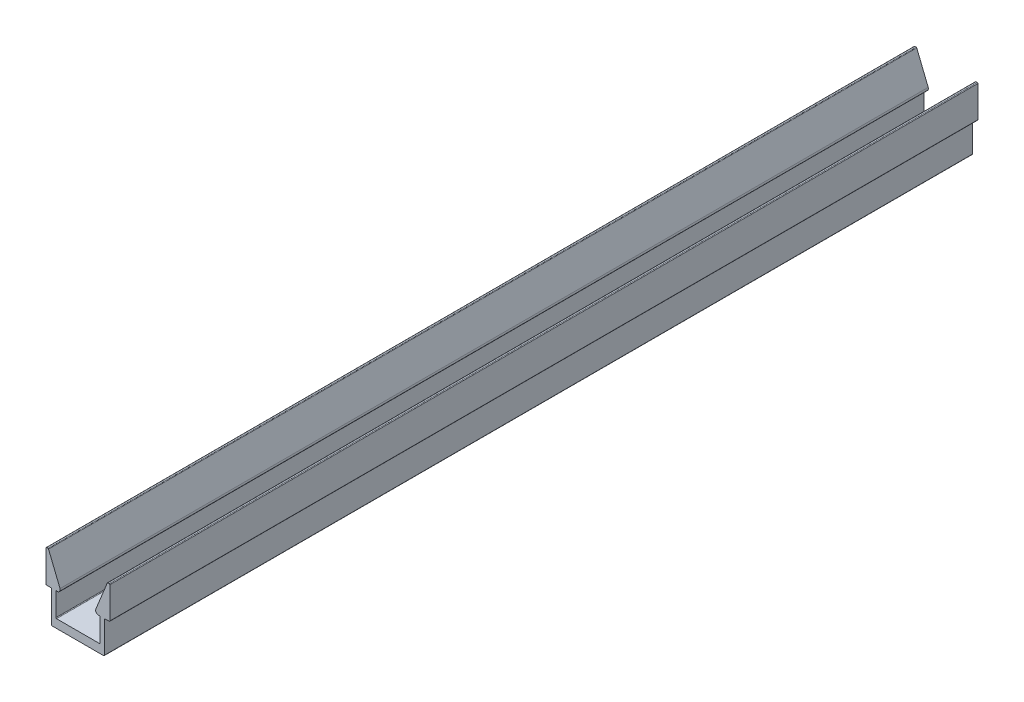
ISO-10303-21;
HEADER;
FILE_DESCRIPTION(('STEP AP214'),'2;1');
FILE_NAME('part.step','',(''),(''),'','','');
FILE_SCHEMA(('AUTOMOTIVE_DESIGN { 1 0 10303 214 1 1 1 1 }'));
ENDSEC;
DATA;
#1=APPLICATION_CONTEXT('core data for automotive mechanical design processes');
#2=APPLICATION_PROTOCOL_DEFINITION('international standard','automotive_design',2000,#1);
#3=PRODUCT_CONTEXT('',#1,'mechanical');
#4=PRODUCT('Part','Part','',(#3));
#5=PRODUCT_RELATED_PRODUCT_CATEGORY('part','',(#4));
#6=PRODUCT_DEFINITION_FORMATION('','',#4);
#7=PRODUCT_DEFINITION_CONTEXT('part definition',#1,'design');
#8=PRODUCT_DEFINITION('design','',#6,#7);
#9=PRODUCT_DEFINITION_SHAPE('','',#8);
#10=(LENGTH_UNIT() NAMED_UNIT(*) SI_UNIT(.MILLI.,.METRE.));
#11=(NAMED_UNIT(*) PLANE_ANGLE_UNIT() SI_UNIT($,.RADIAN.));
#12=(NAMED_UNIT(*) SI_UNIT($,.STERADIAN.) SOLID_ANGLE_UNIT());
#13=UNCERTAINTY_MEASURE_WITH_UNIT(LENGTH_MEASURE(1.E-05),#10,'distance_accuracy_value','');
#14=(GEOMETRIC_REPRESENTATION_CONTEXT(3) GLOBAL_UNCERTAINTY_ASSIGNED_CONTEXT((#13)) GLOBAL_UNIT_ASSIGNED_CONTEXT((#10,
#11,#12)) REPRESENTATION_CONTEXT('',''));
#15=CARTESIAN_POINT('',(0.,0.,0.));
#16=DIRECTION('',(0.,0.,1.));
#17=DIRECTION('',(1.,0.,0.));
#18=AXIS2_PLACEMENT_3D('',#15,#16,#17);
#19=CARTESIAN_POINT('',(-12.5095,4.953,0.));
#20=DIRECTION('',(0.,-1.,0.));
#21=DIRECTION('',(0.,0.,1.));
#22=AXIS2_PLACEMENT_3D('',#19,#20,#21);
#23=PLANE('',#22);
#24=DIRECTION('',(0.,0.,1.));
#25=VECTOR('',#24,1.);
#26=CARTESIAN_POINT('',(-12.5095,4.953,0.));
#27=LINE('',#26,#25);
#28=CARTESIAN_POINT('',(-12.5095,4.953,0.));
#29=VERTEX_POINT('',#28);
#30=CARTESIAN_POINT('',(-12.5095,4.953,508.));
#31=VERTEX_POINT('',#30);
#32=EDGE_CURVE('E22',#29,#31,#27,.T.);
#33=ORIENTED_EDGE('',*,*,#32,.T.);
#34=DIRECTION('',(1.,0.,0.));
#35=VECTOR('',#34,1.);
#36=CARTESIAN_POINT('',(-12.5095,4.953,508.));
#37=LINE('',#36,#35);
#38=CARTESIAN_POINT('',(12.5095,4.953,508.));
#39=VERTEX_POINT('',#38);
#40=EDGE_CURVE('E234',#31,#39,#37,.T.);
#41=ORIENTED_EDGE('',*,*,#40,.T.);
#42=DIRECTION('',(0.,0.,1.));
#43=VECTOR('',#42,1.);
#44=CARTESIAN_POINT('',(12.5095,4.953,0.));
#45=LINE('',#44,#43);
#46=CARTESIAN_POINT('',(12.5095,4.953,0.));
#47=VERTEX_POINT('',#46);
#48=EDGE_CURVE('E422',#47,#39,#45,.T.);
#49=ORIENTED_EDGE('',*,*,#48,.F.);
#50=DIRECTION('',(1.,0.,0.));
#51=VECTOR('',#50,1.);
#52=CARTESIAN_POINT('',(-12.5095,4.953,0.));
#53=LINE('',#52,#51);
#54=EDGE_CURVE('E317',#29,#47,#53,.T.);
#55=ORIENTED_EDGE('',*,*,#54,.F.);
#56=EDGE_LOOP('',(#33,#41,#49,#55));
#57=FACE_BOUND('',#56,.T.);
#58=ADVANCED_FACE('F14',(#57),#23,.F.);
#59=CARTESIAN_POINT('',(15.0495,0.,0.));
#60=DIRECTION('',(0.,1.,0.));
#61=DIRECTION('',(0.,0.,-1.));
#62=AXIS2_PLACEMENT_3D('',#59,#60,#61);
#63=PLANE('',#62);
#64=DIRECTION('',(0.,0.,1.));
#65=VECTOR('',#64,1.);
#66=CARTESIAN_POINT('',(15.0495,0.,0.));
#67=LINE('',#66,#65);
#68=CARTESIAN_POINT('',(15.0495,0.,0.));
#69=VERTEX_POINT('',#68);
#70=CARTESIAN_POINT('',(15.0495,0.,508.));
#71=VERTEX_POINT('',#70);
#72=EDGE_CURVE('E394',#69,#71,#67,.T.);
#73=ORIENTED_EDGE('',*,*,#72,.T.);
#74=DIRECTION('',(-1.,0.,0.));
#75=VECTOR('',#74,1.);
#76=CARTESIAN_POINT('',(15.0495,0.,508.));
#77=LINE('',#76,#75);
#78=CARTESIAN_POINT('',(-15.0495,0.,508.));
#79=VERTEX_POINT('',#78);
#80=EDGE_CURVE('E279',#71,#79,#77,.T.);
#81=ORIENTED_EDGE('',*,*,#80,.T.);
#82=DIRECTION('',(0.,0.,1.));
#83=VECTOR('',#82,1.);
#84=CARTESIAN_POINT('',(-15.0495,0.,0.));
#85=LINE('',#84,#83);
#86=CARTESIAN_POINT('',(-15.0495,0.,0.));
#87=VERTEX_POINT('',#86);
#88=EDGE_CURVE('E392',#87,#79,#85,.T.);
#89=ORIENTED_EDGE('',*,*,#88,.F.);
#90=DIRECTION('',(-1.,0.,0.));
#91=VECTOR('',#90,1.);
#92=CARTESIAN_POINT('',(15.0495,0.,0.));
#93=LINE('',#92,#91);
#94=EDGE_CURVE('E347',#69,#87,#93,.T.);
#95=ORIENTED_EDGE('',*,*,#94,.F.);
#96=EDGE_LOOP('',(#73,#81,#89,#95));
#97=FACE_BOUND('',#96,.T.);
#98=ADVANCED_FACE('F443',(#97),#63,.F.);
#99=CARTESIAN_POINT('',(-12.8905,19.05,0.));
#100=DIRECTION('',(-1.,0.,0.));
#101=DIRECTION('',(0.,0.,1.));
#102=AXIS2_PLACEMENT_3D('',#99,#100,#101);
#103=PLANE('',#102);
#104=DIRECTION('',(0.,0.,1.));
#105=VECTOR('',#104,1.);
#106=CARTESIAN_POINT('',(-12.8905,19.05,0.));
#107=LINE('',#106,#105);
#108=CARTESIAN_POINT('',(-12.8905,19.05,0.));
#109=VERTEX_POINT('',#108);
#110=CARTESIAN_POINT('',(-12.8905,19.05,508.));
#111=VERTEX_POINT('',#110);
#112=EDGE_CURVE('E210',#109,#111,#107,.T.);
#113=ORIENTED_EDGE('',*,*,#112,.T.);
#114=DIRECTION('',(0.,-1.,0.));
#115=VECTOR('',#114,1.);
#116=CARTESIAN_POINT('',(-12.8905,19.05,508.));
#117=LINE('',#116,#115);
#118=CARTESIAN_POINT('',(-12.8905,5.334,508.));
#119=VERTEX_POINT('',#118);
#120=EDGE_CURVE('E213',#111,#119,#117,.T.);
#121=ORIENTED_EDGE('',*,*,#120,.T.);
#122=DIRECTION('',(0.,0.,1.));
#123=VECTOR('',#122,1.);
#124=CARTESIAN_POINT('',(-12.8905,5.334,0.));
#125=LINE('',#124,#123);
#126=CARTESIAN_POINT('',(-12.8905,5.334,0.));
#127=VERTEX_POINT('',#126);
#128=EDGE_CURVE('E9',#127,#119,#125,.T.);
#129=ORIENTED_EDGE('',*,*,#128,.F.);
#130=DIRECTION('',(0.,-1.,0.));
#131=VECTOR('',#130,1.);
#132=CARTESIAN_POINT('',(-12.8905,19.05,0.));
#133=LINE('',#132,#131);
#134=EDGE_CURVE('E214',#109,#127,#133,.T.);
#135=ORIENTED_EDGE('',*,*,#134,.F.);
#136=EDGE_LOOP('',(#113,#121,#129,#135));
#137=FACE_BOUND('',#136,.T.);
#138=ADVANCED_FACE('F16',(#137),#103,.F.);
#139=CARTESIAN_POINT('',(-12.5095,5.334,0.));
#140=DIRECTION('',(0.,0.,1.));
#141=DIRECTION('',(1.,0.,0.));
#142=AXIS2_PLACEMENT_3D('',#139,#140,#141);
#143=CYLINDRICAL_SURFACE('',#142,0.381);
#144=ORIENTED_EDGE('',*,*,#128,.T.);
#145=CARTESIAN_POINT('',(-12.5095,5.334,508.));
#146=DIRECTION('',(0.,0.,1.));
#147=DIRECTION('',(0.,-1.,0.));
#148=AXIS2_PLACEMENT_3D('',#145,#146,#147);
#149=CIRCLE('',#148,0.381);
#150=EDGE_CURVE('E228',#119,#31,#149,.T.);
#151=ORIENTED_EDGE('',*,*,#150,.T.);
#152=ORIENTED_EDGE('',*,*,#32,.F.);
#153=CARTESIAN_POINT('',(-12.5095,5.334,0.));
#154=DIRECTION('',(0.,0.,1.));
#155=DIRECTION('',(1.,0.,0.));
#156=AXIS2_PLACEMENT_3D('',#153,#154,#155);
#157=CIRCLE('',#156,0.381);
#158=EDGE_CURVE('E315',#127,#29,#157,.T.);
#159=ORIENTED_EDGE('',*,*,#158,.F.);
#160=EDGE_LOOP('',(#144,#151,#152,#159));
#161=FACE_BOUND('',#160,.T.);
#162=ADVANCED_FACE('F430',(#161),#143,.F.);
#163=CARTESIAN_POINT('',(12.5095,5.334,0.));
#164=DIRECTION('',(0.,0.,1.));
#165=DIRECTION('',(1.,0.,0.));
#166=AXIS2_PLACEMENT_3D('',#163,#164,#165);
#167=CYLINDRICAL_SURFACE('',#166,0.381);
#168=ORIENTED_EDGE('',*,*,#48,.T.);
#169=CARTESIAN_POINT('',(12.5095,5.334,508.));
#170=DIRECTION('',(0.,0.,1.));
#171=DIRECTION('',(0.,-1.,0.));
#172=AXIS2_PLACEMENT_3D('',#169,#170,#171);
#173=CIRCLE('',#172,0.381);
#174=CARTESIAN_POINT('',(12.8905,5.334,508.));
#175=VERTEX_POINT('',#174);
#176=EDGE_CURVE('E237',#39,#175,#173,.T.);
#177=ORIENTED_EDGE('',*,*,#176,.T.);
#178=DIRECTION('',(0.,0.,1.));
#179=VECTOR('',#178,1.);
#180=CARTESIAN_POINT('',(12.8905,5.334,0.));
#181=LINE('',#180,#179);
#182=CARTESIAN_POINT('',(12.8905,5.334,0.));
#183=VERTEX_POINT('',#182);
#184=EDGE_CURVE('E420',#183,#175,#181,.T.);
#185=ORIENTED_EDGE('',*,*,#184,.F.);
#186=CARTESIAN_POINT('',(12.5095,5.334,0.));
#187=DIRECTION('',(0.,0.,1.));
#188=DIRECTION('',(-1.,0.,0.));
#189=AXIS2_PLACEMENT_3D('',#186,#187,#188);
#190=CIRCLE('',#189,0.381);
#191=EDGE_CURVE('E319',#47,#183,#190,.T.);
#192=ORIENTED_EDGE('',*,*,#191,.F.);
#193=EDGE_LOOP('',(#168,#177,#185,#192));
#194=FACE_BOUND('',#193,.T.);
#195=ADVANCED_FACE('F451',(#194),#167,.F.);
#196=CARTESIAN_POINT('',(12.8905,19.05,0.));
#197=DIRECTION('',(1.,0.,0.));
#198=DIRECTION('',(0.,0.,-1.));
#199=AXIS2_PLACEMENT_3D('',#196,#197,#198);
#200=PLANE('',#199);
#201=ORIENTED_EDGE('',*,*,#184,.T.);
#202=DIRECTION('',(0.,1.,0.));
#203=VECTOR('',#202,1.);
#204=CARTESIAN_POINT('',(12.8905,5.334,508.));
#205=LINE('',#204,#203);
#206=CARTESIAN_POINT('',(12.8905,19.05,508.));
#207=VERTEX_POINT('',#206);
#208=EDGE_CURVE('E240',#175,#207,#205,.T.);
#209=ORIENTED_EDGE('',*,*,#208,.T.);
#210=DIRECTION('',(0.,0.,1.));
#211=VECTOR('',#210,1.);
#212=CARTESIAN_POINT('',(12.8905,19.05,0.));
#213=LINE('',#212,#211);
#214=CARTESIAN_POINT('',(12.8905,19.05,0.));
#215=VERTEX_POINT('',#214);
#216=EDGE_CURVE('E418',#215,#207,#213,.T.);
#217=ORIENTED_EDGE('',*,*,#216,.F.);
#218=DIRECTION('',(0.,1.,0.));
#219=VECTOR('',#218,1.);
#220=CARTESIAN_POINT('',(12.8905,19.05,0.));
#221=LINE('',#220,#219);
#222=EDGE_CURVE('E321',#183,#215,#221,.T.);
#223=ORIENTED_EDGE('',*,*,#222,.F.);
#224=EDGE_LOOP('',(#201,#209,#217,#223));
#225=FACE_BOUND('',#224,.T.);
#226=ADVANCED_FACE('F458',(#225),#200,.F.);
#227=CARTESIAN_POINT('',(11.9288659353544,19.05,0.));
#228=DIRECTION('',(0.,1.,0.));
#229=DIRECTION('',(0.,0.,-1.));
#230=AXIS2_PLACEMENT_3D('',#227,#228,#229);
#231=PLANE('',#230);
#232=ORIENTED_EDGE('',*,*,#216,.T.);
#233=DIRECTION('',(-1.,0.,0.));
#234=VECTOR('',#233,1.);
#235=CARTESIAN_POINT('',(12.8905,19.05,508.));
#236=LINE('',#235,#234);
#237=CARTESIAN_POINT('',(11.9288659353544,19.05,508.));
#238=VERTEX_POINT('',#237);
#239=EDGE_CURVE('E243',#207,#238,#236,.T.);
#240=ORIENTED_EDGE('',*,*,#239,.T.);
#241=DIRECTION('',(0.,0.,1.));
#242=VECTOR('',#241,1.);
#243=CARTESIAN_POINT('',(11.9288659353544,19.05,0.));
#244=LINE('',#243,#242);
#245=CARTESIAN_POINT('',(11.9288659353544,19.05,0.));
#246=VERTEX_POINT('',#245);
#247=EDGE_CURVE('E416',#246,#238,#244,.T.);
#248=ORIENTED_EDGE('',*,*,#247,.F.);
#249=DIRECTION('',(-1.,0.,0.));
#250=VECTOR('',#249,1.);
#251=CARTESIAN_POINT('',(11.9288659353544,19.05,0.));
#252=LINE('',#251,#250);
#253=EDGE_CURVE('E323',#215,#246,#252,.T.);
#254=ORIENTED_EDGE('',*,*,#253,.F.);
#255=EDGE_LOOP('',(#232,#240,#248,#254));
#256=FACE_BOUND('',#255,.T.);
#257=ADVANCED_FACE('F498',(#256),#231,.F.);
#258=CARTESIAN_POINT('',(11.9288659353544,20.6375,0.));
#259=DIRECTION('',(0.,0.,1.));
#260=DIRECTION('',(1.,0.,0.));
#261=AXIS2_PLACEMENT_3D('',#258,#259,#260);
#262=CYLINDRICAL_SURFACE('',#261,1.5875);
#263=ORIENTED_EDGE('',*,*,#247,.T.);
#264=CARTESIAN_POINT('',(11.9288659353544,20.6375,508.));
#265=DIRECTION('',(0.,0.,-1.));
#266=DIRECTION('',(0.,-1.,0.));
#267=AXIS2_PLACEMENT_3D('',#264,#265,#266);
#268=CIRCLE('',#267,1.5875);
#269=CARTESIAN_POINT('',(10.4569615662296,21.2321879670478,508.));
#270=VERTEX_POINT('',#269);
#271=EDGE_CURVE('E246',#238,#270,#268,.T.);
#272=ORIENTED_EDGE('',*,*,#271,.T.);
#273=DIRECTION('',(0.,0.,1.));
#274=VECTOR('',#273,1.);
#275=CARTESIAN_POINT('',(10.4569615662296,21.2321879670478,0.));
#276=LINE('',#275,#274);
#277=CARTESIAN_POINT('',(10.4569615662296,21.2321879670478,0.));
#278=VERTEX_POINT('',#277);
#279=EDGE_CURVE('E414',#278,#270,#276,.T.);
#280=ORIENTED_EDGE('',*,*,#279,.F.);
#281=CARTESIAN_POINT('',(11.9288659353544,20.6375,0.));
#282=DIRECTION('',(0.,0.,-1.));
#283=DIRECTION('',(1.,0.,0.));
#284=AXIS2_PLACEMENT_3D('',#281,#282,#283);
#285=CIRCLE('',#284,1.5875);
#286=EDGE_CURVE('E325',#246,#278,#285,.T.);
#287=ORIENTED_EDGE('',*,*,#286,.F.);
#288=EDGE_LOOP('',(#263,#272,#280,#287));
#289=FACE_BOUND('',#288,.T.);
#290=ADVANCED_FACE('F506',(#289),#262,.T.);
#291=CARTESIAN_POINT('',(17.175730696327,37.8617251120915,0.));
#292=DIRECTION('',(0.92718385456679,-0.374606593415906,0.));
#293=DIRECTION('',(-0.374606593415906,-0.92718385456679,0.));
#294=AXIS2_PLACEMENT_3D('',#291,#292,#293);
#295=PLANE('',#294);
#296=ORIENTED_EDGE('',*,*,#279,.T.);
#297=DIRECTION('',(0.374606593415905,0.92718385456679,0.));
#298=VECTOR('',#297,1.);
#299=CARTESIAN_POINT('',(10.4569615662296,21.2321879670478,508.));
#300=LINE('',#299,#298);
#301=CARTESIAN_POINT('',(17.175730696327,37.8617251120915,508.));
#302=VERTEX_POINT('',#301);
#303=EDGE_CURVE('E249',#270,#302,#300,.T.);
#304=ORIENTED_EDGE('',*,*,#303,.T.);
#305=DIRECTION('',(0.,0.,1.));
#306=VECTOR('',#305,1.);
#307=CARTESIAN_POINT('',(17.175730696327,37.8617251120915,0.));
#308=LINE('',#307,#306);
#309=CARTESIAN_POINT('',(17.175730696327,37.8617251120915,0.));
#310=VERTEX_POINT('',#309);
#311=EDGE_CURVE('E412',#310,#302,#308,.T.);
#312=ORIENTED_EDGE('',*,*,#311,.F.);
#313=DIRECTION('',(0.374606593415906,0.92718385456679,0.));
#314=VECTOR('',#313,1.);
#315=CARTESIAN_POINT('',(17.175730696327,37.8617251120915,0.));
#316=LINE('',#315,#314);
#317=EDGE_CURVE('E327',#278,#310,#316,.T.);
#318=ORIENTED_EDGE('',*,*,#317,.F.);
#319=EDGE_LOOP('',(#296,#304,#312,#318));
#320=FACE_BOUND('',#319,.T.);
#321=ADVANCED_FACE('F515',(#320),#295,.F.);
#322=CARTESIAN_POINT('',(17.528987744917,37.719,0.));
#323=DIRECTION('',(0.,0.,1.));
#324=DIRECTION('',(1.,0.,0.));
#325=AXIS2_PLACEMENT_3D('',#322,#323,#324);
#326=CYLINDRICAL_SURFACE('',#325,0.381);
#327=ORIENTED_EDGE('',*,*,#311,.T.);
#328=CARTESIAN_POINT('',(17.528987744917,37.719,508.));
#329=DIRECTION('',(0.,0.,-1.));
#330=DIRECTION('',(0.,-1.,0.));
#331=AXIS2_PLACEMENT_3D('',#328,#329,#330);
#332=CIRCLE('',#331,0.381);
#333=CARTESIAN_POINT('',(17.528987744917,38.1,508.));
#334=VERTEX_POINT('',#333);
#335=EDGE_CURVE('E252',#302,#334,#332,.T.);
#336=ORIENTED_EDGE('',*,*,#335,.T.);
#337=DIRECTION('',(0.,0.,1.));
#338=VECTOR('',#337,1.);
#339=CARTESIAN_POINT('',(17.528987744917,38.1,0.));
#340=LINE('',#339,#338);
#341=CARTESIAN_POINT('',(17.528987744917,38.1,0.));
#342=VERTEX_POINT('',#341);
#343=EDGE_CURVE('E410',#342,#334,#340,.T.);
#344=ORIENTED_EDGE('',*,*,#343,.F.);
#345=CARTESIAN_POINT('',(17.528987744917,37.719,0.));
#346=DIRECTION('',(0.,0.,-1.));
#347=DIRECTION('',(1.,0.,0.));
#348=AXIS2_PLACEMENT_3D('',#345,#346,#347);
#349=CIRCLE('',#348,0.381);
#350=EDGE_CURVE('E329',#310,#342,#349,.T.);
#351=ORIENTED_EDGE('',*,*,#350,.F.);
#352=EDGE_LOOP('',(#327,#336,#344,#351));
#353=FACE_BOUND('',#352,.T.);
#354=ADVANCED_FACE('F524',(#353),#326,.T.);
#355=CARTESIAN_POINT('',(18.288,38.1,0.));
#356=DIRECTION('',(0.,-1.,0.));
#357=DIRECTION('',(-1.,0.,0.));
#358=AXIS2_PLACEMENT_3D('',#355,#356,#357);
#359=PLANE('',#358);
#360=ORIENTED_EDGE('',*,*,#343,.T.);
#361=DIRECTION('',(1.,0.,0.));
#362=VECTOR('',#361,1.);
#363=CARTESIAN_POINT('',(17.528987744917,38.1,508.));
#364=LINE('',#363,#362);
#365=CARTESIAN_POINT('',(18.288,38.1,508.));
#366=VERTEX_POINT('',#365);
#367=EDGE_CURVE('E255',#334,#366,#364,.T.);
#368=ORIENTED_EDGE('',*,*,#367,.T.);
#369=DIRECTION('',(0.,0.,1.));
#370=VECTOR('',#369,1.);
#371=CARTESIAN_POINT('',(18.288,38.1,0.));
#372=LINE('',#371,#370);
#373=CARTESIAN_POINT('',(18.288,38.1,0.));
#374=VERTEX_POINT('',#373);
#375=EDGE_CURVE('E408',#374,#366,#372,.T.);
#376=ORIENTED_EDGE('',*,*,#375,.F.);
#377=DIRECTION('',(1.,0.,0.));
#378=VECTOR('',#377,1.);
#379=CARTESIAN_POINT('',(18.288,38.1,0.));
#380=LINE('',#379,#378);
#381=EDGE_CURVE('E331',#342,#374,#380,.T.);
#382=ORIENTED_EDGE('',*,*,#381,.F.);
#383=EDGE_LOOP('',(#360,#368,#376,#382));
#384=FACE_BOUND('',#383,.T.);
#385=ADVANCED_FACE('F533',(#384),#359,.F.);
#386=CARTESIAN_POINT('',(18.288,37.719,0.));
#387=DIRECTION('',(0.,0.,1.));
#388=DIRECTION('',(1.,0.,0.));
#389=AXIS2_PLACEMENT_3D('',#386,#387,#388);
#390=CYLINDRICAL_SURFACE('',#389,0.381);
#391=ORIENTED_EDGE('',*,*,#375,.T.);
#392=CARTESIAN_POINT('',(18.288,37.719,508.));
#393=DIRECTION('',(0.,0.,-1.));
#394=DIRECTION('',(0.,-1.,0.));
#395=AXIS2_PLACEMENT_3D('',#392,#393,#394);
#396=CIRCLE('',#395,0.381);
#397=CARTESIAN_POINT('',(18.669,37.719,508.));
#398=VERTEX_POINT('',#397);
#399=EDGE_CURVE('E258',#366,#398,#396,.T.);
#400=ORIENTED_EDGE('',*,*,#399,.T.);
#401=DIRECTION('',(0.,0.,1.));
#402=VECTOR('',#401,1.);
#403=CARTESIAN_POINT('',(18.669,37.719,0.));
#404=LINE('',#403,#402);
#405=CARTESIAN_POINT('',(18.669,37.719,0.));
#406=VERTEX_POINT('',#405);
#407=EDGE_CURVE('E406',#406,#398,#404,.T.);
#408=ORIENTED_EDGE('',*,*,#407,.F.);
#409=CARTESIAN_POINT('',(18.288,37.719,0.));
#410=DIRECTION('',(0.,0.,-1.));
#411=DIRECTION('',(1.,0.,0.));
#412=AXIS2_PLACEMENT_3D('',#409,#410,#411);
#413=CIRCLE('',#412,0.381);
#414=EDGE_CURVE('E333',#374,#406,#413,.T.);
#415=ORIENTED_EDGE('',*,*,#414,.F.);
#416=EDGE_LOOP('',(#391,#400,#408,#415));
#417=FACE_BOUND('',#416,.T.);
#418=ADVANCED_FACE('F542',(#417),#390,.T.);
#419=CARTESIAN_POINT('',(18.669,19.431,0.));
#420=DIRECTION('',(-1.,0.,0.));
#421=DIRECTION('',(0.,0.,1.));
#422=AXIS2_PLACEMENT_3D('',#419,#420,#421);
#423=PLANE('',#422);
#424=ORIENTED_EDGE('',*,*,#407,.T.);
#425=DIRECTION('',(0.,-1.,0.));
#426=VECTOR('',#425,1.);
#427=CARTESIAN_POINT('',(18.669,37.719,508.));
#428=LINE('',#427,#426);
#429=CARTESIAN_POINT('',(18.669,19.431,508.));
#430=VERTEX_POINT('',#429);
#431=EDGE_CURVE('E261',#398,#430,#428,.T.);
#432=ORIENTED_EDGE('',*,*,#431,.T.);
#433=DIRECTION('',(0.,0.,1.));
#434=VECTOR('',#433,1.);
#435=CARTESIAN_POINT('',(18.669,19.431,0.));
#436=LINE('',#435,#434);
#437=CARTESIAN_POINT('',(18.669,19.431,0.));
#438=VERTEX_POINT('',#437);
#439=EDGE_CURVE('E404',#438,#430,#436,.T.);
#440=ORIENTED_EDGE('',*,*,#439,.F.);
#441=DIRECTION('',(0.,-1.,0.));
#442=VECTOR('',#441,1.);
#443=CARTESIAN_POINT('',(18.669,19.431,0.));
#444=LINE('',#443,#442);
#445=EDGE_CURVE('E335',#406,#438,#444,.T.);
#446=ORIENTED_EDGE('',*,*,#445,.F.);
#447=EDGE_LOOP('',(#424,#432,#440,#446));
#448=FACE_BOUND('',#447,.T.);
#449=ADVANCED_FACE('F551',(#448),#423,.F.);
#450=CARTESIAN_POINT('',(18.288,19.431,0.));
#451=DIRECTION('',(0.,0.,1.));
#452=DIRECTION('',(1.,0.,0.));
#453=AXIS2_PLACEMENT_3D('',#450,#451,#452);
#454=CYLINDRICAL_SURFACE('',#453,0.381);
#455=ORIENTED_EDGE('',*,*,#439,.T.);
#456=CARTESIAN_POINT('',(18.288,19.431,508.));
#457=DIRECTION('',(0.,0.,-1.));
#458=DIRECTION('',(0.,-1.,0.));
#459=AXIS2_PLACEMENT_3D('',#456,#457,#458);
#460=CIRCLE('',#459,0.381);
#461=CARTESIAN_POINT('',(18.288,19.05,508.));
#462=VERTEX_POINT('',#461);
#463=EDGE_CURVE('E264',#430,#462,#460,.T.);
#464=ORIENTED_EDGE('',*,*,#463,.T.);
#465=DIRECTION('',(0.,0.,1.));
#466=VECTOR('',#465,1.);
#467=CARTESIAN_POINT('',(18.288,19.05,0.));
#468=LINE('',#467,#466);
#469=CARTESIAN_POINT('',(18.288,19.05,0.));
#470=VERTEX_POINT('',#469);
#471=EDGE_CURVE('E402',#470,#462,#468,.T.);
#472=ORIENTED_EDGE('',*,*,#471,.F.);
#473=CARTESIAN_POINT('',(18.288,19.431,0.));
#474=DIRECTION('',(0.,0.,-1.));
#475=DIRECTION('',(1.,0.,0.));
#476=AXIS2_PLACEMENT_3D('',#473,#474,#475);
#477=CIRCLE('',#476,0.381);
#478=EDGE_CURVE('E337',#438,#470,#477,.T.);
#479=ORIENTED_EDGE('',*,*,#478,.F.);
#480=EDGE_LOOP('',(#455,#464,#472,#479));
#481=FACE_BOUND('',#480,.T.);
#482=ADVANCED_FACE('F560',(#481),#454,.T.);
#483=CARTESIAN_POINT('',(15.8115,19.05,0.));
#484=DIRECTION('',(0.,1.,0.));
#485=DIRECTION('',(0.,0.,-1.));
#486=AXIS2_PLACEMENT_3D('',#483,#484,#485);
#487=PLANE('',#486);
#488=ORIENTED_EDGE('',*,*,#471,.T.);
#489=DIRECTION('',(-1.,0.,0.));
#490=VECTOR('',#489,1.);
#491=CARTESIAN_POINT('',(18.288,19.05,508.));
#492=LINE('',#491,#490);
#493=CARTESIAN_POINT('',(15.8115,19.05,508.));
#494=VERTEX_POINT('',#493);
#495=EDGE_CURVE('E267',#462,#494,#492,.T.);
#496=ORIENTED_EDGE('',*,*,#495,.T.);
#497=DIRECTION('',(0.,0.,1.));
#498=VECTOR('',#497,1.);
#499=CARTESIAN_POINT('',(15.8115,19.05,0.));
#500=LINE('',#499,#498);
#501=CARTESIAN_POINT('',(15.8115,19.05,0.));
#502=VERTEX_POINT('',#501);
#503=EDGE_CURVE('E400',#502,#494,#500,.T.);
#504=ORIENTED_EDGE('',*,*,#503,.F.);
#505=DIRECTION('',(-1.,0.,0.));
#506=VECTOR('',#505,1.);
#507=CARTESIAN_POINT('',(15.8115,19.05,0.));
#508=LINE('',#507,#506);
#509=EDGE_CURVE('E339',#470,#502,#508,.T.);
#510=ORIENTED_EDGE('',*,*,#509,.F.);
#511=EDGE_LOOP('',(#488,#496,#504,#510));
#512=FACE_BOUND('',#511,.T.);
#513=ADVANCED_FACE('F569',(#512),#487,.F.);
#514=CARTESIAN_POINT('',(15.8115,18.669,0.));
#515=DIRECTION('',(0.,0.,1.));
#516=DIRECTION('',(1.,0.,0.));
#517=AXIS2_PLACEMENT_3D('',#514,#515,#516);
#518=CYLINDRICAL_SURFACE('',#517,0.381);
#519=ORIENTED_EDGE('',*,*,#503,.T.);
#520=CARTESIAN_POINT('',(15.8115,18.669,508.));
#521=DIRECTION('',(0.,0.,1.));
#522=DIRECTION('',(0.,-1.,0.));
#523=AXIS2_PLACEMENT_3D('',#520,#521,#522);
#524=CIRCLE('',#523,0.381);
#525=CARTESIAN_POINT('',(15.4305,18.669,508.));
#526=VERTEX_POINT('',#525);
#527=EDGE_CURVE('E270',#494,#526,#524,.T.);
#528=ORIENTED_EDGE('',*,*,#527,.T.);
#529=DIRECTION('',(0.,0.,1.));
#530=VECTOR('',#529,1.);
#531=CARTESIAN_POINT('',(15.4305,18.669,0.));
#532=LINE('',#531,#530);
#533=CARTESIAN_POINT('',(15.4305,18.669,0.));
#534=VERTEX_POINT('',#533);
#535=EDGE_CURVE('E398',#534,#526,#532,.T.);
#536=ORIENTED_EDGE('',*,*,#535,.F.);
#537=CARTESIAN_POINT('',(15.8115,18.669,0.));
#538=DIRECTION('',(0.,0.,1.));
#539=DIRECTION('',(-1.,0.,0.));
#540=AXIS2_PLACEMENT_3D('',#537,#538,#539);
#541=CIRCLE('',#540,0.381);
#542=EDGE_CURVE('E341',#502,#534,#541,.T.);
#543=ORIENTED_EDGE('',*,*,#542,.F.);
#544=EDGE_LOOP('',(#519,#528,#536,#543));
#545=FACE_BOUND('',#544,.T.);
#546=ADVANCED_FACE('F578',(#545),#518,.F.);
#547=CARTESIAN_POINT('',(15.4305,0.381,0.));
#548=DIRECTION('',(-1.,0.,0.));
#549=DIRECTION('',(0.,0.,1.));
#550=AXIS2_PLACEMENT_3D('',#547,#548,#549);
#551=PLANE('',#550);
#552=ORIENTED_EDGE('',*,*,#535,.T.);
#553=DIRECTION('',(0.,-1.,0.));
#554=VECTOR('',#553,1.);
#555=CARTESIAN_POINT('',(15.4305,18.669,508.));
#556=LINE('',#555,#554);
#557=CARTESIAN_POINT('',(15.4305,0.381,508.));
#558=VERTEX_POINT('',#557);
#559=EDGE_CURVE('E273',#526,#558,#556,.T.);
#560=ORIENTED_EDGE('',*,*,#559,.T.);
#561=DIRECTION('',(0.,0.,1.));
#562=VECTOR('',#561,1.);
#563=CARTESIAN_POINT('',(15.4305,0.381,0.));
#564=LINE('',#563,#562);
#565=CARTESIAN_POINT('',(15.4305,0.381,0.));
#566=VERTEX_POINT('',#565);
#567=EDGE_CURVE('E396',#566,#558,#564,.T.);
#568=ORIENTED_EDGE('',*,*,#567,.F.);
#569=DIRECTION('',(0.,-1.,0.));
#570=VECTOR('',#569,1.);
#571=CARTESIAN_POINT('',(15.4305,0.381,0.));
#572=LINE('',#571,#570);
#573=EDGE_CURVE('E343',#534,#566,#572,.T.);
#574=ORIENTED_EDGE('',*,*,#573,.F.);
#575=EDGE_LOOP('',(#552,#560,#568,#574));
#576=FACE_BOUND('',#575,.T.);
#577=ADVANCED_FACE('F587',(#576),#551,.F.);
#578=CARTESIAN_POINT('',(15.0495,0.381,0.));
#579=DIRECTION('',(0.,0.,1.));
#580=DIRECTION('',(1.,0.,0.));
#581=AXIS2_PLACEMENT_3D('',#578,#579,#580);
#582=CYLINDRICAL_SURFACE('',#581,0.381);
#583=ORIENTED_EDGE('',*,*,#567,.T.);
#584=CARTESIAN_POINT('',(15.0495,0.381,508.));
#585=DIRECTION('',(0.,0.,-1.));
#586=DIRECTION('',(0.,-1.,0.));
#587=AXIS2_PLACEMENT_3D('',#584,#585,#586);
#588=CIRCLE('',#587,0.381);
#589=EDGE_CURVE('E276',#558,#71,#588,.T.);
#590=ORIENTED_EDGE('',*,*,#589,.T.);
#591=ORIENTED_EDGE('',*,*,#72,.F.);
#592=CARTESIAN_POINT('',(15.0495,0.381,0.));
#593=DIRECTION('',(0.,0.,-1.));
#594=DIRECTION('',(1.,0.,0.));
#595=AXIS2_PLACEMENT_3D('',#592,#593,#594);
#596=CIRCLE('',#595,0.381);
#597=EDGE_CURVE('E345',#566,#69,#596,.T.);
#598=ORIENTED_EDGE('',*,*,#597,.F.);
#599=EDGE_LOOP('',(#583,#590,#591,#598));
#600=FACE_BOUND('',#599,.T.);
#601=ADVANCED_FACE('F596',(#600),#582,.T.);
#602=CARTESIAN_POINT('',(-15.0495,0.381,0.));
#603=DIRECTION('',(0.,0.,1.));
#604=DIRECTION('',(1.,0.,0.));
#605=AXIS2_PLACEMENT_3D('',#602,#603,#604);
#606=CYLINDRICAL_SURFACE('',#605,0.381);
#607=ORIENTED_EDGE('',*,*,#88,.T.);
#608=CARTESIAN_POINT('',(-15.0495,0.381,508.));
#609=DIRECTION('',(0.,0.,-1.));
#610=DIRECTION('',(0.,-1.,0.));
#611=AXIS2_PLACEMENT_3D('',#608,#609,#610);
#612=CIRCLE('',#611,0.381);
#613=CARTESIAN_POINT('',(-15.4305,0.381,508.));
#614=VERTEX_POINT('',#613);
#615=EDGE_CURVE('E282',#79,#614,#612,.T.);
#616=ORIENTED_EDGE('',*,*,#615,.T.);
#617=DIRECTION('',(0.,0.,1.));
#618=VECTOR('',#617,1.);
#619=CARTESIAN_POINT('',(-15.4305,0.381,0.));
#620=LINE('',#619,#618);
#621=CARTESIAN_POINT('',(-15.4305,0.381,0.));
#622=VERTEX_POINT('',#621);
#623=EDGE_CURVE('E390',#622,#614,#620,.T.);
#624=ORIENTED_EDGE('',*,*,#623,.F.);
#625=CARTESIAN_POINT('',(-15.0495,0.381,0.));
#626=DIRECTION('',(0.,0.,-1.));
#627=DIRECTION('',(-1.,0.,0.));
#628=AXIS2_PLACEMENT_3D('',#625,#626,#627);
#629=CIRCLE('',#628,0.381);
#630=EDGE_CURVE('E349',#87,#622,#629,.T.);
#631=ORIENTED_EDGE('',*,*,#630,.F.);
#632=EDGE_LOOP('',(#607,#616,#624,#631));
#633=FACE_BOUND('',#632,.T.);
#634=ADVANCED_FACE('F605',(#633),#606,.T.);
#635=CARTESIAN_POINT('',(-15.4305,0.381,0.));
#636=DIRECTION('',(1.,0.,0.));
#637=DIRECTION('',(0.,0.,-1.));
#638=AXIS2_PLACEMENT_3D('',#635,#636,#637);
#639=PLANE('',#638);
#640=ORIENTED_EDGE('',*,*,#623,.T.);
#641=DIRECTION('',(0.,1.,0.));
#642=VECTOR('',#641,1.);
#643=CARTESIAN_POINT('',(-15.4305,0.381,508.));
#644=LINE('',#643,#642);
#645=CARTESIAN_POINT('',(-15.4305,18.669,508.));
#646=VERTEX_POINT('',#645);
#647=EDGE_CURVE('E285',#614,#646,#644,.T.);
#648=ORIENTED_EDGE('',*,*,#647,.T.);
#649=DIRECTION('',(0.,0.,1.));
#650=VECTOR('',#649,1.);
#651=CARTESIAN_POINT('',(-15.4305,18.669,0.));
#652=LINE('',#651,#650);
#653=CARTESIAN_POINT('',(-15.4305,18.669,0.));
#654=VERTEX_POINT('',#653);
#655=EDGE_CURVE('E388',#654,#646,#652,.T.);
#656=ORIENTED_EDGE('',*,*,#655,.F.);
#657=DIRECTION('',(0.,1.,0.));
#658=VECTOR('',#657,1.);
#659=CARTESIAN_POINT('',(-15.4305,0.381,0.));
#660=LINE('',#659,#658);
#661=EDGE_CURVE('E351',#622,#654,#660,.T.);
#662=ORIENTED_EDGE('',*,*,#661,.F.);
#663=EDGE_LOOP('',(#640,#648,#656,#662));
#664=FACE_BOUND('',#663,.T.);
#665=ADVANCED_FACE('F614',(#664),#639,.F.);
#666=CARTESIAN_POINT('',(-15.8115,18.669,0.));
#667=DIRECTION('',(0.,0.,1.));
#668=DIRECTION('',(1.,0.,0.));
#669=AXIS2_PLACEMENT_3D('',#666,#667,#668);
#670=CYLINDRICAL_SURFACE('',#669,0.381);
#671=ORIENTED_EDGE('',*,*,#655,.T.);
#672=CARTESIAN_POINT('',(-15.8115,18.669,508.));
#673=DIRECTION('',(0.,0.,1.));
#674=DIRECTION('',(0.,-1.,0.));
#675=AXIS2_PLACEMENT_3D('',#672,#673,#674);
#676=CIRCLE('',#675,0.381);
#677=CARTESIAN_POINT('',(-15.8115,19.05,508.));
#678=VERTEX_POINT('',#677);
#679=EDGE_CURVE('E288',#646,#678,#676,.T.);
#680=ORIENTED_EDGE('',*,*,#679,.T.);
#681=DIRECTION('',(0.,0.,1.));
#682=VECTOR('',#681,1.);
#683=CARTESIAN_POINT('',(-15.8115,19.05,0.));
#684=LINE('',#683,#682);
#685=CARTESIAN_POINT('',(-15.8115,19.05,0.));
#686=VERTEX_POINT('',#685);
#687=EDGE_CURVE('E386',#686,#678,#684,.T.);
#688=ORIENTED_EDGE('',*,*,#687,.F.);
#689=CARTESIAN_POINT('',(-15.8115,18.669,0.));
#690=DIRECTION('',(0.,0.,1.));
#691=DIRECTION('',(1.,0.,0.));
#692=AXIS2_PLACEMENT_3D('',#689,#690,#691);
#693=CIRCLE('',#692,0.381);
#694=EDGE_CURVE('E353',#654,#686,#693,.T.);
#695=ORIENTED_EDGE('',*,*,#694,.F.);
#696=EDGE_LOOP('',(#671,#680,#688,#695));
#697=FACE_BOUND('',#696,.T.);
#698=ADVANCED_FACE('F623',(#697),#670,.F.);
#699=CARTESIAN_POINT('',(-15.8115,19.05,0.));
#700=DIRECTION('',(0.,1.,0.));
#701=DIRECTION('',(0.,0.,-1.));
#702=AXIS2_PLACEMENT_3D('',#699,#700,#701);
#703=PLANE('',#702);
#704=ORIENTED_EDGE('',*,*,#687,.T.);
#705=DIRECTION('',(-1.,0.,0.));
#706=VECTOR('',#705,1.);
#707=CARTESIAN_POINT('',(-15.8115,19.05,508.));
#708=LINE('',#707,#706);
#709=CARTESIAN_POINT('',(-18.288,19.05,508.));
#710=VERTEX_POINT('',#709);
#711=EDGE_CURVE('E291',#678,#710,#708,.T.);
#712=ORIENTED_EDGE('',*,*,#711,.T.);
#713=DIRECTION('',(0.,0.,1.));
#714=VECTOR('',#713,1.);
#715=CARTESIAN_POINT('',(-18.288,19.05,0.));
#716=LINE('',#715,#714);
#717=CARTESIAN_POINT('',(-18.288,19.05,0.));
#718=VERTEX_POINT('',#717);
#719=EDGE_CURVE('E384',#718,#710,#716,.T.);
#720=ORIENTED_EDGE('',*,*,#719,.F.);
#721=DIRECTION('',(-1.,0.,0.));
#722=VECTOR('',#721,1.);
#723=CARTESIAN_POINT('',(-15.8115,19.05,0.));
#724=LINE('',#723,#722);
#725=EDGE_CURVE('E355',#686,#718,#724,.T.);
#726=ORIENTED_EDGE('',*,*,#725,.F.);
#727=EDGE_LOOP('',(#704,#712,#720,#726));
#728=FACE_BOUND('',#727,.T.);
#729=ADVANCED_FACE('F632',(#728),#703,.F.);
#730=CARTESIAN_POINT('',(-18.288,19.431,0.));
#731=DIRECTION('',(0.,0.,1.));
#732=DIRECTION('',(1.,0.,0.));
#733=AXIS2_PLACEMENT_3D('',#730,#731,#732);
#734=CYLINDRICAL_SURFACE('',#733,0.381);
#735=ORIENTED_EDGE('',*,*,#719,.T.);
#736=CARTESIAN_POINT('',(-18.288,19.431,508.));
#737=DIRECTION('',(0.,0.,-1.));
#738=DIRECTION('',(0.,-1.,0.));
#739=AXIS2_PLACEMENT_3D('',#736,#737,#738);
#740=CIRCLE('',#739,0.381);
#741=CARTESIAN_POINT('',(-18.669,19.431,508.));
#742=VERTEX_POINT('',#741);
#743=EDGE_CURVE('E294',#710,#742,#740,.T.);
#744=ORIENTED_EDGE('',*,*,#743,.T.);
#745=DIRECTION('',(0.,0.,1.));
#746=VECTOR('',#745,1.);
#747=CARTESIAN_POINT('',(-18.669,19.431,0.));
#748=LINE('',#747,#746);
#749=CARTESIAN_POINT('',(-18.669,19.431,0.));
#750=VERTEX_POINT('',#749);
#751=EDGE_CURVE('E382',#750,#742,#748,.T.);
#752=ORIENTED_EDGE('',*,*,#751,.F.);
#753=CARTESIAN_POINT('',(-18.288,19.431,0.));
#754=DIRECTION('',(0.,0.,-1.));
#755=DIRECTION('',(-1.,0.,0.));
#756=AXIS2_PLACEMENT_3D('',#753,#754,#755);
#757=CIRCLE('',#756,0.381);
#758=EDGE_CURVE('E357',#718,#750,#757,.T.);
#759=ORIENTED_EDGE('',*,*,#758,.F.);
#760=EDGE_LOOP('',(#735,#744,#752,#759));
#761=FACE_BOUND('',#760,.T.);
#762=ADVANCED_FACE('F641',(#761),#734,.T.);
#763=CARTESIAN_POINT('',(-18.669,19.431,0.));
#764=DIRECTION('',(1.,0.,0.));
#765=DIRECTION('',(0.,0.,-1.));
#766=AXIS2_PLACEMENT_3D('',#763,#764,#765);
#767=PLANE('',#766);
#768=ORIENTED_EDGE('',*,*,#751,.T.);
#769=DIRECTION('',(0.,1.,0.));
#770=VECTOR('',#769,1.);
#771=CARTESIAN_POINT('',(-18.669,19.431,508.));
#772=LINE('',#771,#770);
#773=CARTESIAN_POINT('',(-18.669,37.719,508.));
#774=VERTEX_POINT('',#773);
#775=EDGE_CURVE('E297',#742,#774,#772,.T.);
#776=ORIENTED_EDGE('',*,*,#775,.T.);
#777=DIRECTION('',(0.,0.,1.));
#778=VECTOR('',#777,1.);
#779=CARTESIAN_POINT('',(-18.669,37.719,0.));
#780=LINE('',#779,#778);
#781=CARTESIAN_POINT('',(-18.669,37.719,0.));
#782=VERTEX_POINT('',#781);
#783=EDGE_CURVE('E380',#782,#774,#780,.T.);
#784=ORIENTED_EDGE('',*,*,#783,.F.);
#785=DIRECTION('',(0.,1.,0.));
#786=VECTOR('',#785,1.);
#787=CARTESIAN_POINT('',(-18.669,19.431,0.));
#788=LINE('',#787,#786);
#789=EDGE_CURVE('E359',#750,#782,#788,.T.);
#790=ORIENTED_EDGE('',*,*,#789,.F.);
#791=EDGE_LOOP('',(#768,#776,#784,#790));
#792=FACE_BOUND('',#791,.T.);
#793=ADVANCED_FACE('F650',(#792),#767,.F.);
#794=CARTESIAN_POINT('',(-18.288,37.719,0.));
#795=DIRECTION('',(0.,0.,1.));
#796=DIRECTION('',(1.,0.,0.));
#797=AXIS2_PLACEMENT_3D('',#794,#795,#796);
#798=CYLINDRICAL_SURFACE('',#797,0.381);
#799=ORIENTED_EDGE('',*,*,#783,.T.);
#800=CARTESIAN_POINT('',(-18.288,37.719,508.));
#801=DIRECTION('',(0.,0.,-1.));
#802=DIRECTION('',(0.,-1.,0.));
#803=AXIS2_PLACEMENT_3D('',#800,#801,#802);
#804=CIRCLE('',#803,0.381);
#805=CARTESIAN_POINT('',(-18.288,38.1,508.));
#806=VERTEX_POINT('',#805);
#807=EDGE_CURVE('E300',#774,#806,#804,.T.);
#808=ORIENTED_EDGE('',*,*,#807,.T.);
#809=DIRECTION('',(0.,0.,1.));
#810=VECTOR('',#809,1.);
#811=CARTESIAN_POINT('',(-18.288,38.1,0.));
#812=LINE('',#811,#810);
#813=CARTESIAN_POINT('',(-18.288,38.1,0.));
#814=VERTEX_POINT('',#813);
#815=EDGE_CURVE('E378',#814,#806,#812,.T.);
#816=ORIENTED_EDGE('',*,*,#815,.F.);
#817=CARTESIAN_POINT('',(-18.288,37.719,0.));
#818=DIRECTION('',(0.,0.,-1.));
#819=DIRECTION('',(-1.,0.,0.));
#820=AXIS2_PLACEMENT_3D('',#817,#818,#819);
#821=CIRCLE('',#820,0.381);
#822=EDGE_CURVE('E361',#782,#814,#821,.T.);
#823=ORIENTED_EDGE('',*,*,#822,.F.);
#824=EDGE_LOOP('',(#799,#808,#816,#823));
#825=FACE_BOUND('',#824,.T.);
#826=ADVANCED_FACE('F659',(#825),#798,.T.);
#827=CARTESIAN_POINT('',(-18.288,38.1,0.));
#828=DIRECTION('',(0.,-1.,0.));
#829=DIRECTION('',(-1.,0.,0.));
#830=AXIS2_PLACEMENT_3D('',#827,#828,#829);
#831=PLANE('',#830);
#832=ORIENTED_EDGE('',*,*,#815,.T.);
#833=DIRECTION('',(1.,0.,0.));
#834=VECTOR('',#833,1.);
#835=CARTESIAN_POINT('',(-18.288,38.1,508.));
#836=LINE('',#835,#834);
#837=CARTESIAN_POINT('',(-17.528987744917,38.1,508.));
#838=VERTEX_POINT('',#837);
#839=EDGE_CURVE('E303',#806,#838,#836,.T.);
#840=ORIENTED_EDGE('',*,*,#839,.T.);
#841=DIRECTION('',(0.,0.,1.));
#842=VECTOR('',#841,1.);
#843=CARTESIAN_POINT('',(-17.528987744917,38.1,0.));
#844=LINE('',#843,#842);
#845=CARTESIAN_POINT('',(-17.528987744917,38.1,0.));
#846=VERTEX_POINT('',#845);
#847=EDGE_CURVE('E376',#846,#838,#844,.T.);
#848=ORIENTED_EDGE('',*,*,#847,.F.);
#849=DIRECTION('',(1.,0.,0.));
#850=VECTOR('',#849,1.);
#851=CARTESIAN_POINT('',(-18.288,38.1,0.));
#852=LINE('',#851,#850);
#853=EDGE_CURVE('E363',#814,#846,#852,.T.);
#854=ORIENTED_EDGE('',*,*,#853,.F.);
#855=EDGE_LOOP('',(#832,#840,#848,#854));
#856=FACE_BOUND('',#855,.T.);
#857=ADVANCED_FACE('F668',(#856),#831,.F.);
#858=CARTESIAN_POINT('',(-17.528987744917,37.719,0.));
#859=DIRECTION('',(0.,0.,1.));
#860=DIRECTION('',(1.,0.,0.));
#861=AXIS2_PLACEMENT_3D('',#858,#859,#860);
#862=CYLINDRICAL_SURFACE('',#861,0.381);
#863=ORIENTED_EDGE('',*,*,#847,.T.);
#864=CARTESIAN_POINT('',(-17.528987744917,37.719,508.));
#865=DIRECTION('',(0.,0.,-1.));
#866=DIRECTION('',(0.,-1.,0.));
#867=AXIS2_PLACEMENT_3D('',#864,#865,#866);
#868=CIRCLE('',#867,0.381);
#869=CARTESIAN_POINT('',(-17.175730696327,37.8617251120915,508.));
#870=VERTEX_POINT('',#869);
#871=EDGE_CURVE('E306',#838,#870,#868,.T.);
#872=ORIENTED_EDGE('',*,*,#871,.T.);
#873=DIRECTION('',(0.,0.,1.));
#874=VECTOR('',#873,1.);
#875=CARTESIAN_POINT('',(-17.175730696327,37.8617251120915,0.));
#876=LINE('',#875,#874);
#877=CARTESIAN_POINT('',(-17.175730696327,37.8617251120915,0.));
#878=VERTEX_POINT('',#877);
#879=EDGE_CURVE('E374',#878,#870,#876,.T.);
#880=ORIENTED_EDGE('',*,*,#879,.F.);
#881=CARTESIAN_POINT('',(-17.528987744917,37.719,0.));
#882=DIRECTION('',(0.,0.,-1.));
#883=DIRECTION('',(-1.,0.,0.));
#884=AXIS2_PLACEMENT_3D('',#881,#882,#883);
#885=CIRCLE('',#884,0.381);
#886=EDGE_CURVE('E365',#846,#878,#885,.T.);
#887=ORIENTED_EDGE('',*,*,#886,.F.);
#888=EDGE_LOOP('',(#863,#872,#880,#887));
#889=FACE_BOUND('',#888,.T.);
#890=ADVANCED_FACE('F677',(#889),#862,.T.);
#891=CARTESIAN_POINT('',(-17.175730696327,37.8617251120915,0.));
#892=DIRECTION('',(-0.92718385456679,-0.374606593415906,0.));
#893=DIRECTION('',(-0.374606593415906,0.92718385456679,0.));
#894=AXIS2_PLACEMENT_3D('',#891,#892,#893);
#895=PLANE('',#894);
#896=ORIENTED_EDGE('',*,*,#879,.T.);
#897=DIRECTION('',(0.374606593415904,-0.92718385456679,0.));
#898=VECTOR('',#897,1.);
#899=CARTESIAN_POINT('',(-17.175730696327,37.8617251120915,508.));
#900=LINE('',#899,#898);
#901=CARTESIAN_POINT('',(-10.4569615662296,21.2321879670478,508.));
#902=VERTEX_POINT('',#901);
#903=EDGE_CURVE('E309',#870,#902,#900,.T.);
#904=ORIENTED_EDGE('',*,*,#903,.T.);
#905=DIRECTION('',(0.,0.,1.));
#906=VECTOR('',#905,1.);
#907=CARTESIAN_POINT('',(-10.4569615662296,21.2321879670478,0.));
#908=LINE('',#907,#906);
#909=CARTESIAN_POINT('',(-10.4569615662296,21.2321879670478,0.));
#910=VERTEX_POINT('',#909);
#911=EDGE_CURVE('E372',#910,#902,#908,.T.);
#912=ORIENTED_EDGE('',*,*,#911,.F.);
#913=DIRECTION('',(0.374606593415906,-0.92718385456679,0.));
#914=VECTOR('',#913,1.);
#915=CARTESIAN_POINT('',(-17.175730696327,37.8617251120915,0.));
#916=LINE('',#915,#914);
#917=EDGE_CURVE('E367',#878,#910,#916,.T.);
#918=ORIENTED_EDGE('',*,*,#917,.F.);
#919=EDGE_LOOP('',(#896,#904,#912,#918));
#920=FACE_BOUND('',#919,.T.);
#921=ADVANCED_FACE('F686',(#920),#895,.F.);
#922=CARTESIAN_POINT('',(-11.9288659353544,20.6375,0.));
#923=DIRECTION('',(0.,0.,1.));
#924=DIRECTION('',(1.,0.,0.));
#925=AXIS2_PLACEMENT_3D('',#922,#923,#924);
#926=CYLINDRICAL_SURFACE('',#925,1.5875);
#927=ORIENTED_EDGE('',*,*,#911,.T.);
#928=CARTESIAN_POINT('',(-11.9288659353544,20.6375,508.));
#929=DIRECTION('',(0.,0.,-1.));
#930=DIRECTION('',(0.,-1.,0.));
#931=AXIS2_PLACEMENT_3D('',#928,#929,#930);
#932=CIRCLE('',#931,1.5875);
#933=CARTESIAN_POINT('',(-11.9288659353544,19.05,508.));
#934=VERTEX_POINT('',#933);
#935=EDGE_CURVE('E312',#902,#934,#932,.T.);
#936=ORIENTED_EDGE('',*,*,#935,.T.);
#937=DIRECTION('',(0.,0.,1.));
#938=VECTOR('',#937,1.);
#939=CARTESIAN_POINT('',(-11.9288659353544,19.05,0.));
#940=LINE('',#939,#938);
#941=CARTESIAN_POINT('',(-11.9288659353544,19.05,0.));
#942=VERTEX_POINT('',#941);
#943=EDGE_CURVE('E217',#942,#934,#940,.T.);
#944=ORIENTED_EDGE('',*,*,#943,.F.);
#945=CARTESIAN_POINT('',(-11.9288659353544,20.6375,0.));
#946=DIRECTION('',(0.,0.,-1.));
#947=DIRECTION('',(-1.,0.,0.));
#948=AXIS2_PLACEMENT_3D('',#945,#946,#947);
#949=CIRCLE('',#948,1.5875);
#950=EDGE_CURVE('E34',#910,#942,#949,.T.);
#951=ORIENTED_EDGE('',*,*,#950,.F.);
#952=EDGE_LOOP('',(#927,#936,#944,#951));
#953=FACE_BOUND('',#952,.T.);
#954=ADVANCED_FACE('F440',(#953),#926,.T.);
#955=CARTESIAN_POINT('',(-11.9288659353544,19.05,0.));
#956=DIRECTION('',(0.,1.,0.));
#957=DIRECTION('',(0.,0.,-1.));
#958=AXIS2_PLACEMENT_3D('',#955,#956,#957);
#959=PLANE('',#958);
#960=ORIENTED_EDGE('',*,*,#943,.T.);
#961=DIRECTION('',(-1.,0.,0.));
#962=VECTOR('',#961,1.);
#963=CARTESIAN_POINT('',(-11.9288659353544,19.05,508.));
#964=LINE('',#963,#962);
#965=EDGE_CURVE('E224',#934,#111,#964,.T.);
#966=ORIENTED_EDGE('',*,*,#965,.T.);
#967=ORIENTED_EDGE('',*,*,#112,.F.);
#968=DIRECTION('',(-1.,0.,0.));
#969=VECTOR('',#968,1.);
#970=CARTESIAN_POINT('',(-11.9288659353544,19.05,0.));
#971=LINE('',#970,#969);
#972=EDGE_CURVE('E29',#942,#109,#971,.T.);
#973=ORIENTED_EDGE('',*,*,#972,.F.);
#974=EDGE_LOOP('',(#960,#966,#967,#973));
#975=FACE_BOUND('',#974,.T.);
#976=ADVANCED_FACE('F230',(#975),#959,.F.);
#977=CARTESIAN_POINT('',(-12.5095,5.334,0.));
#978=DIRECTION('',(0.,0.,1.));
#979=DIRECTION('',(1.,0.,0.));
#980=AXIS2_PLACEMENT_3D('',#977,#978,#979);
#981=PLANE('',#980);
#982=ORIENTED_EDGE('',*,*,#134,.T.);
#983=ORIENTED_EDGE('',*,*,#158,.T.);
#984=ORIENTED_EDGE('',*,*,#54,.T.);
#985=ORIENTED_EDGE('',*,*,#191,.T.);
#986=ORIENTED_EDGE('',*,*,#222,.T.);
#987=ORIENTED_EDGE('',*,*,#253,.T.);
#988=ORIENTED_EDGE('',*,*,#286,.T.);
#989=ORIENTED_EDGE('',*,*,#317,.T.);
#990=ORIENTED_EDGE('',*,*,#350,.T.);
#991=ORIENTED_EDGE('',*,*,#381,.T.);
#992=ORIENTED_EDGE('',*,*,#414,.T.);
#993=ORIENTED_EDGE('',*,*,#445,.T.);
#994=ORIENTED_EDGE('',*,*,#478,.T.);
#995=ORIENTED_EDGE('',*,*,#509,.T.);
#996=ORIENTED_EDGE('',*,*,#542,.T.);
#997=ORIENTED_EDGE('',*,*,#573,.T.);
#998=ORIENTED_EDGE('',*,*,#597,.T.);
#999=ORIENTED_EDGE('',*,*,#94,.T.);
#1000=ORIENTED_EDGE('',*,*,#630,.T.);
#1001=ORIENTED_EDGE('',*,*,#661,.T.);
#1002=ORIENTED_EDGE('',*,*,#694,.T.);
#1003=ORIENTED_EDGE('',*,*,#725,.T.);
#1004=ORIENTED_EDGE('',*,*,#758,.T.);
#1005=ORIENTED_EDGE('',*,*,#789,.T.);
#1006=ORIENTED_EDGE('',*,*,#822,.T.);
#1007=ORIENTED_EDGE('',*,*,#853,.T.);
#1008=ORIENTED_EDGE('',*,*,#886,.T.);
#1009=ORIENTED_EDGE('',*,*,#917,.T.);
#1010=ORIENTED_EDGE('',*,*,#950,.T.);
#1011=ORIENTED_EDGE('',*,*,#972,.T.);
#1012=EDGE_LOOP('',(#982,#983,#984,#985,#986,#987,#988,#989,#990,#991,#992,#993,#994,#995,#996,
#997,#998,#999,#1000,#1001,#1002,#1003,#1004,#1005,#1006,#1007,#1008,#1009,#1010,#1011));
#1013=FACE_BOUND('',#1012,.T.);
#1014=ADVANCED_FACE('F431',(#1013),#981,.F.);
#1015=CARTESIAN_POINT('',(-12.5095,5.334,508.));
#1016=DIRECTION('',(0.,0.,-1.));
#1017=DIRECTION('',(0.,-1.,0.));
#1018=AXIS2_PLACEMENT_3D('',#1015,#1016,#1017);
#1019=PLANE('',#1018);
#1020=ORIENTED_EDGE('',*,*,#965,.F.);
#1021=ORIENTED_EDGE('',*,*,#935,.F.);
#1022=ORIENTED_EDGE('',*,*,#903,.F.);
#1023=ORIENTED_EDGE('',*,*,#871,.F.);
#1024=ORIENTED_EDGE('',*,*,#839,.F.);
#1025=ORIENTED_EDGE('',*,*,#807,.F.);
#1026=ORIENTED_EDGE('',*,*,#775,.F.);
#1027=ORIENTED_EDGE('',*,*,#743,.F.);
#1028=ORIENTED_EDGE('',*,*,#711,.F.);
#1029=ORIENTED_EDGE('',*,*,#679,.F.);
#1030=ORIENTED_EDGE('',*,*,#647,.F.);
#1031=ORIENTED_EDGE('',*,*,#615,.F.);
#1032=ORIENTED_EDGE('',*,*,#80,.F.);
#1033=ORIENTED_EDGE('',*,*,#589,.F.);
#1034=ORIENTED_EDGE('',*,*,#559,.F.);
#1035=ORIENTED_EDGE('',*,*,#527,.F.);
#1036=ORIENTED_EDGE('',*,*,#495,.F.);
#1037=ORIENTED_EDGE('',*,*,#463,.F.);
#1038=ORIENTED_EDGE('',*,*,#431,.F.);
#1039=ORIENTED_EDGE('',*,*,#399,.F.);
#1040=ORIENTED_EDGE('',*,*,#367,.F.);
#1041=ORIENTED_EDGE('',*,*,#335,.F.);
#1042=ORIENTED_EDGE('',*,*,#303,.F.);
#1043=ORIENTED_EDGE('',*,*,#271,.F.);
#1044=ORIENTED_EDGE('',*,*,#239,.F.);
#1045=ORIENTED_EDGE('',*,*,#208,.F.);
#1046=ORIENTED_EDGE('',*,*,#176,.F.);
#1047=ORIENTED_EDGE('',*,*,#40,.F.);
#1048=ORIENTED_EDGE('',*,*,#150,.F.);
#1049=ORIENTED_EDGE('',*,*,#120,.F.);
#1050=EDGE_LOOP('',(#1020,#1021,#1022,#1023,#1024,#1025,#1026,#1027,#1028,#1029,#1030,#1031,
#1032,#1033,#1034,#1035,#1036,#1037,#1038,#1039,#1040,#1041,#1042,#1043,#1044,#1045,#1046,#1047,
#1048,#1049));
#1051=FACE_BOUND('',#1050,.T.);
#1052=ADVANCED_FACE('F222',(#1051),#1019,.F.);
#1053=CLOSED_SHELL('',(#58,#98,#138,#162,#195,#226,#257,#290,#321,#354,#385,#418,#449,#482,#513,
#546,#577,#601,#634,#665,#698,#729,#762,#793,#826,#857,#890,#921,#954,#976,#1014,#1052));
#1054=MANIFOLD_SOLID_BREP('B1',#1053);
#1055=ADVANCED_BREP_SHAPE_REPRESENTATION('',(#18,#1054),#14);
#1056=SHAPE_DEFINITION_REPRESENTATION(#9,#1055);
ENDSEC;
END-ISO-10303-21;
